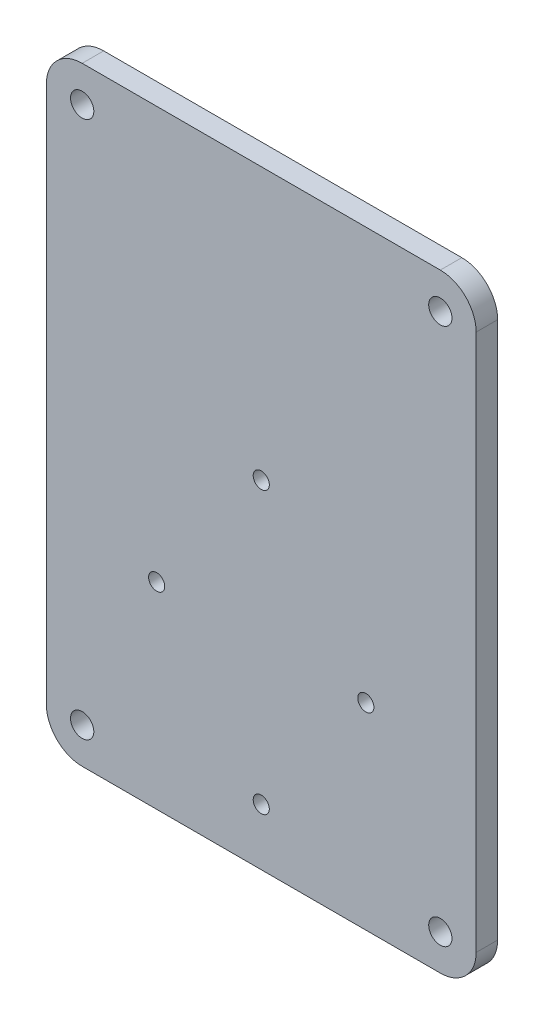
from build123d import *

# Parameters (mm, degrees)
SKETCH_1_W          = 120
SKETCH_1_H          = 170
EXTRUDE_1_DEPTH     = 6
SKETCH_2_R          = 2.25
CUT_EXTRUDE_1_DEPTH = 105.216121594
FILLET_1_R          = 10
SKETCH_3_R          = 3.25
CUT_EXTRUDE_2_DEPTH = 105.216121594


with BuildPart() as part:
    # Sketch 1 → Extrude 1 (new body)
    with BuildSketch(Plane.XY):
        Rectangle(SKETCH_1_W, SKETCH_1_H)
    extrude(amount=EXTRUDE_1_DEPTH)

    # Sketch 2 → Cut-Extrude 1 (cut, through all)
    with BuildSketch(Plane.XY.offset(6)):
        with Locations((-29.2, -30)):
            Circle(SKETCH_2_R)
        with Locations((0, -69.2)):
            Circle(SKETCH_2_R)
        with Locations((29.2, -30)):
            Circle(SKETCH_2_R)
        with Locations((0, 9.2)):
            Circle(SKETCH_2_R)
    extrude(amount=-CUT_EXTRUDE_1_DEPTH, mode=Mode.SUBTRACT)

    # Fillet 1
    fillet_1_edges = [part.edges().sort_by_distance(p)[0] for p in [
        (60, -85, 3),
        (-60, -85, 3),
        (-60, 85, 3),
        (60, 85, 3),
    ]]
    fillet(fillet_1_edges, radius=FILLET_1_R)

    # Sketch 3 → Cut-Extrude 2 (cut, through all)
    with BuildSketch(Plane.XY.offset(6)):
        with Locations((-50, 75)):
            Circle(SKETCH_3_R)
        with Locations((50, 75)):
            Circle(SKETCH_3_R)
        with Locations((50, -75)):
            Circle(SKETCH_3_R)
        with Locations((-50, -75)):
            Circle(SKETCH_3_R)
    extrude(amount=-CUT_EXTRUDE_2_DEPTH, mode=Mode.SUBTRACT)


solid = part.part
